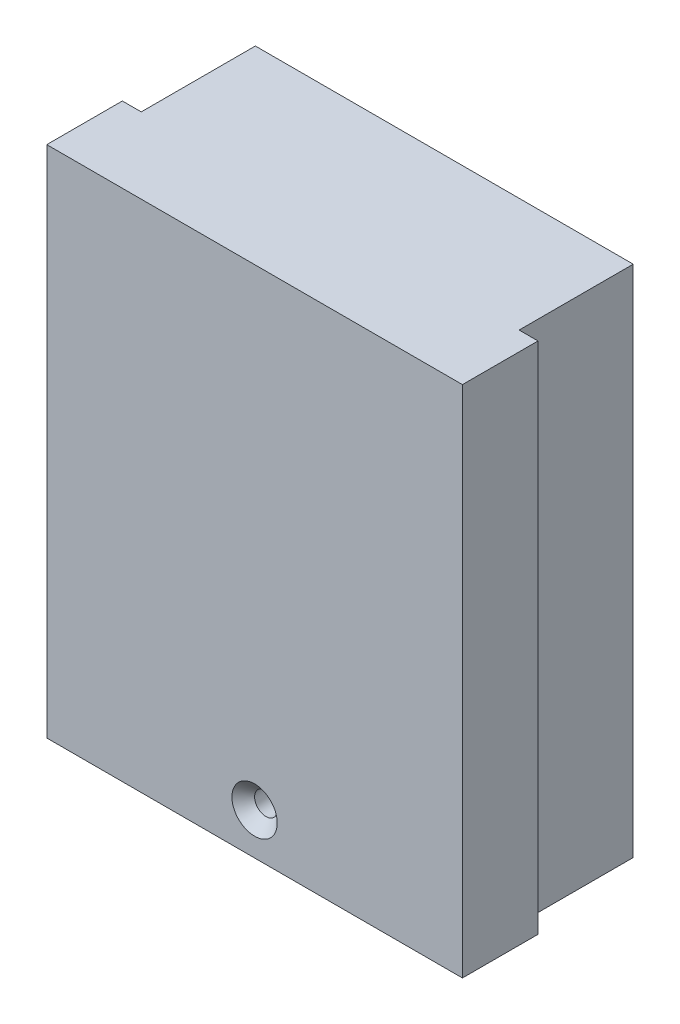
from build123d import *

# Parameters (mm, degrees)
SECTION_PROFIL_DEPTH          = 68
ESQUISSE4_R                   = 1.5
CAROTTE_BASSE_DEPTH           = 78.053293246
CAROTTE_BASSE_DRAFT           = 2
ESQUISSE5_R                   = 1.5
C_NE_D_APPUI_BUSE_BASSE_DEPTH = 78.053293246
C_NE_D_APPUI_BUSE_BASSE_DRAFT = 45


with BuildPart() as part:
    # Esquisse1 → section profil (new body)
    with BuildSketch(Plane(origin=(0, 0, 0), x_dir=(1, 0, 0), z_dir=(0, 1, 0))):
        Polygon((-25, 25.1), (25, 25.1), (25, 10), (27.5, 10), (27.5, 0), (-27.5, 0), (-27.5, 10), (-25, 10), align=None)
    extrude(amount=SECTION_PROFIL_DEPTH)


with BuildPart() as carotte_basse_tool:
    # Esquisse4 → carotte basse (with draft: the straight prism first)
    with BuildSketch(Plane.XY.offset(-1.5)):
        with Locations((0, 5.5)):
            Circle(ESQUISSE4_R)
    extrude(amount=-CAROTTE_BASSE_DEPTH)
    # carotte basse: the draft: its side faces are tilted about the plane it starts from
    carotte_basse_sides = [carotte_basse_tool.faces().sort_by_distance(p)[0] for p in [
        (-1.5, 5.5, -40.526646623),
    ]]
    draft(carotte_basse_sides, Plane.XY.offset(-1.5), CAROTTE_BASSE_DRAFT)


with BuildPart() as part_1:
    add(part.part)

    # carotte basse: cut by carotte_basse_tool
    add(carotte_basse_tool.part, mode=Mode.SUBTRACT)


with BuildPart() as c_ne_d_appui_buse_basse_tool:
    # Esquisse5 → c_ne d_appui buse basse (with draft: the straight prism first)
    with BuildSketch(Plane(origin=(0, 0, -1.5), x_dir=(-1, 0, 0), z_dir=(0, 0, -1))):
        with Locations((0, 5.5)):
            Circle(ESQUISSE5_R)
    extrude(amount=-C_NE_D_APPUI_BUSE_BASSE_DEPTH)
    # c_ne d_appui buse basse: the draft: its side faces are tilted about the plane it starts from
    c_ne_d_appui_buse_basse_sides = [c_ne_d_appui_buse_basse_tool.faces().sort_by_distance(p)[0] for p in [
        (1.5, 5.5, 37.526646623),
    ]]
    draft(c_ne_d_appui_buse_basse_sides, Plane(origin=(0, 0, -1.5), x_dir=(-1, 0, 0), z_dir=(0, 0, -1)), C_NE_D_APPUI_BUSE_BASSE_DRAFT)


with BuildPart() as part_2:
    add(part_1.part)

    # c_ne d_appui buse basse: cut by c_ne_d_appui_buse_basse_tool
    add(c_ne_d_appui_buse_basse_tool.part, mode=Mode.SUBTRACT)


solid = part_2.part
